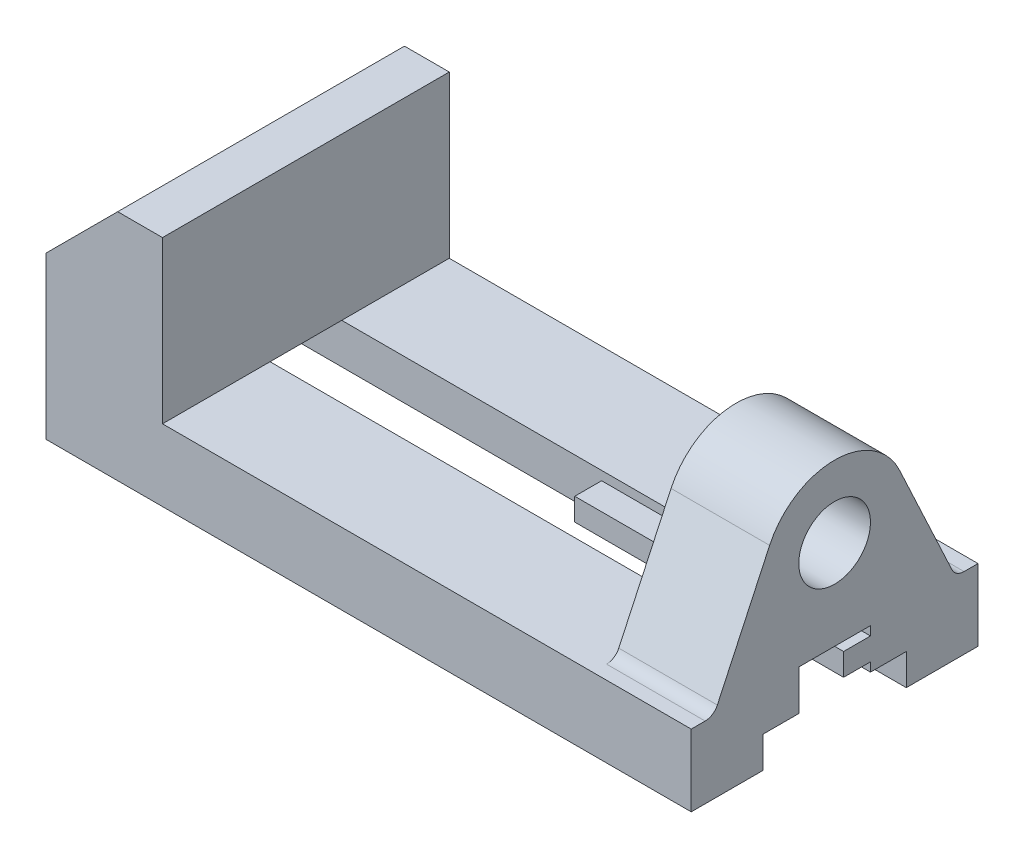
from build123d import *

# Parameters (mm, degrees)
BOSS_EXTRUDE1_DEPTH       = 32
SKETCH2_R                 = 8
BOSS_EXTRUDE2_DEPTH       = 22
FILLET1_R                 = 3
CUT_EXTRUDE1_DEPTH        = 157.409718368
M6X1_0_TAPPED_HOLE1_D     = 6
M6X1_0_TAPPED_HOLE1_DEPTH = 10
M6X1_0_TAPPED_HOLE1_TIP   = 1.802581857
SKETCH7_W                 = 6
SKETCH7_H                 = 5
BOSS_EXTRUDE3_DEPTH       = 60


with BuildPart() as part:
    # Sketch1 → Boss-Extrude1 (new, symmetric)
    with BuildSketch(Plane.XY):
        Polygon((0, 36), (0, 0), (144, 0), (144, 16), (26, 16), (26, 52), (16, 52), align=None)
    extrude(amount=BOSS_EXTRUDE1_DEPTH, both=True)

    # Sketch2 → Boss-Extrude2 (add)
    with BuildSketch(Plane(origin=(144, 0, 0), x_dir=(0, 0, -1), z_dir=(1, 0, 0))):
        with BuildLine():
            Line((-26.980199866, 16), (-14.500924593, 42.761892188))
            ThreePointArc((-14.500924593, 42.761892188), (0, 52), (14.500924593, 42.761892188))
            Line((14.500924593, 42.761892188), (26.980199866, 16))
            Line((26.980199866, 16), (-26.980199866, 16))
        make_face()
        with Locations((0, 36)):
            Circle(SKETCH2_R, mode=Mode.SUBTRACT)
    extrude(amount=-BOSS_EXTRUDE2_DEPTH)

    # Fillet1
    fillet1_edges = [part.edges().sort_by_distance(p)[0] for p in [
        (133, 16, -26.980199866),
        (133, 16, 26.980199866),
    ]]
    fillet(fillet1_edges, radius=FILLET1_R)

    # Sketch3 → Cut-Extrude1 (cut, through all)
    with BuildSketch(Plane(origin=(144, 0, 0), x_dir=(0, 0, -1), z_dir=(1, 0, 0))):
        Polygon((-16, 0), (-16, 7), (-8, 7), (-8, 16), (8, 16), (8, 7), (16, 7), (16, 0), align=None)
    extrude(amount=-CUT_EXTRUDE1_DEPTH, mode=Mode.SUBTRACT)

    # M6x1.0 Tapped Hole1
    with Locations(Plane.XZ):
        with Locations((106, -22), (36, -22), (36, 22), (106, 22)):
            Hole(M6X1_0_TAPPED_HOLE1_D / 2, depth=M6X1_0_TAPPED_HOLE1_DEPTH)
            with Locations((0, 0, -(M6X1_0_TAPPED_HOLE1_DEPTH + M6X1_0_TAPPED_HOLE1_TIP / 2))):  # 118° drill point
                Cone(0, M6X1_0_TAPPED_HOLE1_D / 2, M6X1_0_TAPPED_HOLE1_TIP, mode=Mode.SUBTRACT)

    # Sketch7 → Boss-Extrude3 (add)
    with BuildSketch(Plane(origin=(144, 0, 0), x_dir=(0, 0, -1), z_dir=(1, 0, 0))):
        with Locations((5, 11.5)):
            Rectangle(SKETCH7_W, SKETCH7_H)
    extrude(amount=-BOSS_EXTRUDE3_DEPTH)


solid = part.part
